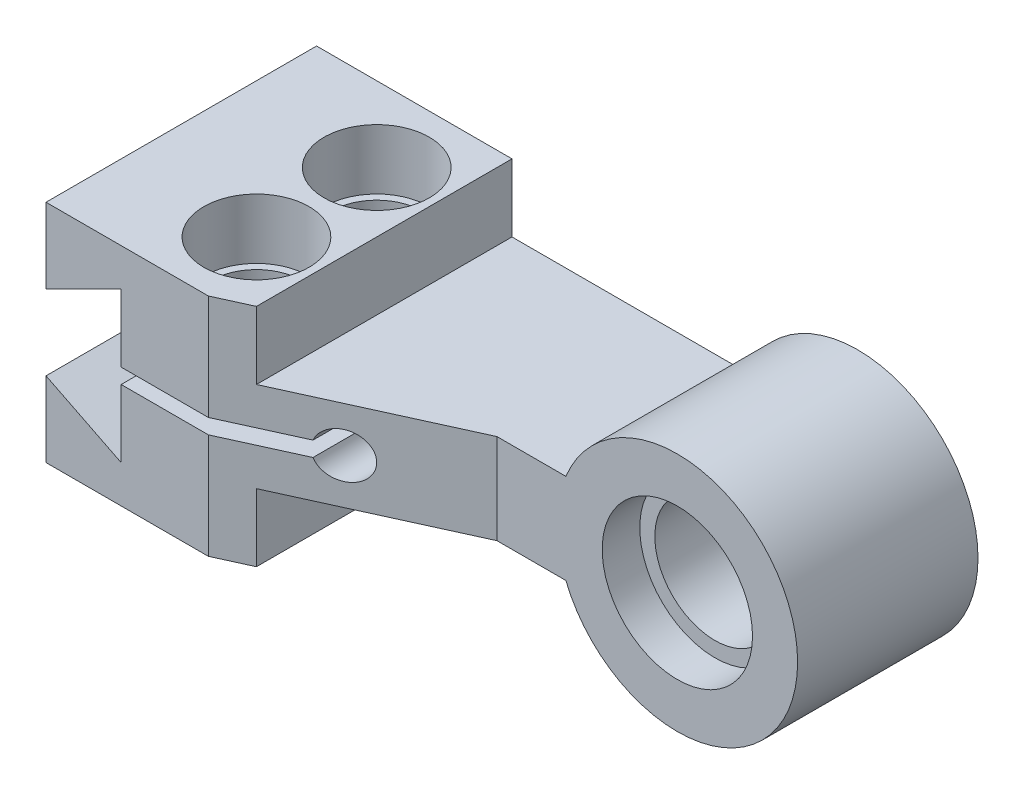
ISO-10303-21;
HEADER;
FILE_DESCRIPTION(('STEP AP214'),'2;1');
FILE_NAME('part.step','',(''),(''),'','','');
FILE_SCHEMA(('AUTOMOTIVE_DESIGN { 1 0 10303 214 1 1 1 1 }'));
ENDSEC;
DATA;
#1=APPLICATION_CONTEXT('core data for automotive mechanical design processes');
#2=APPLICATION_PROTOCOL_DEFINITION('international standard','automotive_design',2000,#1);
#3=PRODUCT_CONTEXT('',#1,'mechanical');
#4=PRODUCT('Part','Part','',(#3));
#5=PRODUCT_RELATED_PRODUCT_CATEGORY('part','',(#4));
#6=PRODUCT_DEFINITION_FORMATION('','',#4);
#7=PRODUCT_DEFINITION_CONTEXT('part definition',#1,'design');
#8=PRODUCT_DEFINITION('design','',#6,#7);
#9=PRODUCT_DEFINITION_SHAPE('','',#8);
#10=(LENGTH_UNIT() NAMED_UNIT(*) SI_UNIT(.MILLI.,.METRE.));
#11=(NAMED_UNIT(*) PLANE_ANGLE_UNIT() SI_UNIT($,.RADIAN.));
#12=(NAMED_UNIT(*) SI_UNIT($,.STERADIAN.) SOLID_ANGLE_UNIT());
#13=UNCERTAINTY_MEASURE_WITH_UNIT(LENGTH_MEASURE(1.E-05),#10,'distance_accuracy_value','');
#14=(GEOMETRIC_REPRESENTATION_CONTEXT(3) GLOBAL_UNCERTAINTY_ASSIGNED_CONTEXT((#13)) GLOBAL_UNIT_ASSIGNED_CONTEXT((#10,
#11,#12)) REPRESENTATION_CONTEXT('',''));
#15=CARTESIAN_POINT('',(0.,0.,0.));
#16=DIRECTION('',(0.,0.,1.));
#17=DIRECTION('',(1.,0.,0.));
#18=AXIS2_PLACEMENT_3D('',#15,#16,#17);
#19=CARTESIAN_POINT('',(0.,0.,12.));
#20=DIRECTION('',(0.,0.,-1.));
#21=DIRECTION('',(-1.,0.,0.));
#22=AXIS2_PLACEMENT_3D('',#19,#20,#21);
#23=CYLINDRICAL_SURFACE('',#22,4.);
#24=CARTESIAN_POINT('',(0.,0.,0.));
#25=DIRECTION('',(0.,0.,1.));
#26=DIRECTION('',(1.,0.,0.));
#27=AXIS2_PLACEMENT_3D('',#24,#25,#26);
#28=CIRCLE('',#27,4.);
#29=CARTESIAN_POINT('',(4.,0.,0.));
#30=VERTEX_POINT('',#29);
#31=EDGE_CURVE('E396',#30,#30,#28,.T.);
#32=ORIENTED_EDGE('',*,*,#31,.F.);
#33=EDGE_LOOP('',(#32));
#34=FACE_BOUND('',#33,.T.);
#35=CARTESIAN_POINT('',(0.,0.,9.5));
#36=DIRECTION('',(0.,0.,1.));
#37=DIRECTION('',(1.,0.,0.));
#38=AXIS2_PLACEMENT_3D('',#35,#36,#37);
#39=CIRCLE('',#38,4.);
#40=CARTESIAN_POINT('',(4.,0.,9.5));
#41=VERTEX_POINT('',#40);
#42=EDGE_CURVE('E35',#41,#41,#39,.T.);
#43=ORIENTED_EDGE('',*,*,#42,.T.);
#44=EDGE_LOOP('',(#43));
#45=FACE_BOUND('',#44,.T.);
#46=ADVANCED_FACE('F31',(#34,#45),#23,.F.);
#47=CARTESIAN_POINT('',(-23.,-7.5,18.));
#48=DIRECTION('',(0.,1.,0.));
#49=DIRECTION('',(0.,0.,1.));
#50=AXIS2_PLACEMENT_3D('',#47,#48,#49);
#51=PLANE('',#50);
#52=CARTESIAN_POINT('',(-27.,-7.5,5.));
#53=DIRECTION('',(0.,-1.,0.));
#54=DIRECTION('',(0.,0.,-1.));
#55=AXIS2_PLACEMENT_3D('',#52,#53,#54);
#56=CIRCLE('',#55,2.5);
#57=CARTESIAN_POINT('',(-27.,-7.5,2.5));
#58=VERTEX_POINT('',#57);
#59=EDGE_CURVE('E740',#58,#58,#56,.T.);
#60=ORIENTED_EDGE('',*,*,#59,.F.);
#61=EDGE_LOOP('',(#60));
#62=FACE_BOUND('',#61,.T.);
#63=DIRECTION('',(0.,0.,-1.));
#64=VECTOR('',#63,1.);
#65=CARTESIAN_POINT('',(-23.,-7.5,0.));
#66=LINE('',#65,#64);
#67=CARTESIAN_POINT('',(-23.,-7.5,17.));
#68=VERTEX_POINT('',#67);
#69=CARTESIAN_POINT('',(-23.,-7.5,0.));
#70=VERTEX_POINT('',#69);
#71=EDGE_CURVE('E236',#68,#70,#66,.T.);
#72=ORIENTED_EDGE('',*,*,#71,.F.);
#73=DIRECTION('',(0.910366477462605,0.,-0.413802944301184));
#74=VECTOR('',#73,1.);
#75=CARTESIAN_POINT('',(-25.2,-7.5,18.));
#76=LINE('',#75,#74);
#77=CARTESIAN_POINT('',(-25.2,-7.5,18.));
#78=VERTEX_POINT('',#77);
#79=EDGE_CURVE('E241',#78,#68,#76,.T.);
#80=ORIENTED_EDGE('',*,*,#79,.F.);
#81=DIRECTION('',(1.,0.,0.));
#82=VECTOR('',#81,1.);
#83=CARTESIAN_POINT('',(-36.,-7.5,18.));
#84=LINE('',#83,#82);
#85=CARTESIAN_POINT('',(-36.,-7.5,18.));
#86=VERTEX_POINT('',#85);
#87=EDGE_CURVE('E258',#86,#78,#84,.T.);
#88=ORIENTED_EDGE('',*,*,#87,.F.);
#89=DIRECTION('',(0.,0.,1.));
#90=VECTOR('',#89,1.);
#91=CARTESIAN_POINT('',(-36.,-7.5,0.));
#92=LINE('',#91,#90);
#93=CARTESIAN_POINT('',(-36.,-7.5,0.));
#94=VERTEX_POINT('',#93);
#95=EDGE_CURVE('E255',#94,#86,#92,.T.);
#96=ORIENTED_EDGE('',*,*,#95,.F.);
#97=DIRECTION('',(-1.,0.,0.));
#98=VECTOR('',#97,1.);
#99=CARTESIAN_POINT('',(-23.,-7.5,0.));
#100=LINE('',#99,#98);
#101=EDGE_CURVE('E252',#70,#94,#100,.T.);
#102=ORIENTED_EDGE('',*,*,#101,.F.);
#103=EDGE_LOOP('',(#72,#80,#88,#96,#102));
#104=FACE_BOUND('',#103,.T.);
#105=CARTESIAN_POINT('',(-27.,-7.5,13.));
#106=DIRECTION('',(0.,-1.,0.));
#107=DIRECTION('',(0.,0.,-1.));
#108=AXIS2_PLACEMENT_3D('',#105,#106,#107);
#109=CIRCLE('',#108,2.5);
#110=CARTESIAN_POINT('',(-27.,-7.5,10.5));
#111=VERTEX_POINT('',#110);
#112=EDGE_CURVE('E732',#111,#111,#109,.T.);
#113=ORIENTED_EDGE('',*,*,#112,.F.);
#114=EDGE_LOOP('',(#113));
#115=FACE_BOUND('',#114,.T.);
#116=ADVANCED_FACE('F305',(#62,#104,#115),#51,.F.);
#117=CARTESIAN_POINT('',(-27.,-8.001,13.));
#118=DIRECTION('',(0.,1.,0.));
#119=DIRECTION('',(0.,0.,1.));
#120=AXIS2_PLACEMENT_3D('',#117,#118,#119);
#121=CYLINDRICAL_SURFACE('',#120,2.99999999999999);
#122=CARTESIAN_POINT('',(-27.,0.5,13.));
#123=DIRECTION('',(0.,-1.,0.));
#124=DIRECTION('',(1.,0.,0.));
#125=AXIS2_PLACEMENT_3D('',#122,#123,#124);
#126=CIRCLE('',#125,2.99999999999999);
#127=CARTESIAN_POINT('',(-24.,0.500000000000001,13.));
#128=VERTEX_POINT('',#127);
#129=EDGE_CURVE('E199',#128,#128,#126,.F.);
#130=ORIENTED_EDGE('',*,*,#129,.F.);
#131=EDGE_LOOP('',(#130));
#132=FACE_BOUND('',#131,.T.);
#133=CARTESIAN_POINT('',(-27.,3.5,13.));
#134=DIRECTION('',(0.,1.,0.));
#135=DIRECTION('',(0.,0.,1.));
#136=AXIS2_PLACEMENT_3D('',#133,#134,#135);
#137=CIRCLE('',#136,2.99999999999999);
#138=CARTESIAN_POINT('',(-27.,3.5,16.));
#139=VERTEX_POINT('',#138);
#140=EDGE_CURVE('E332',#139,#139,#137,.F.);
#141=ORIENTED_EDGE('',*,*,#140,.F.);
#142=EDGE_LOOP('',(#141));
#143=FACE_BOUND('',#142,.T.);
#144=ADVANCED_FACE('F359',(#132,#143),#121,.F.);
#145=CARTESIAN_POINT('',(-27.,-8.001,5.));
#146=DIRECTION('',(0.,1.,0.));
#147=DIRECTION('',(0.,0.,1.));
#148=AXIS2_PLACEMENT_3D('',#145,#146,#147);
#149=CYLINDRICAL_SURFACE('',#148,2.99999999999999);
#150=CARTESIAN_POINT('',(-27.,0.5,5.));
#151=DIRECTION('',(0.,-1.,0.));
#152=DIRECTION('',(1.,0.,0.));
#153=AXIS2_PLACEMENT_3D('',#150,#151,#152);
#154=CIRCLE('',#153,2.99999999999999);
#155=CARTESIAN_POINT('',(-24.,0.500000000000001,5.));
#156=VERTEX_POINT('',#155);
#157=EDGE_CURVE('E330',#156,#156,#154,.F.);
#158=ORIENTED_EDGE('',*,*,#157,.F.);
#159=EDGE_LOOP('',(#158));
#160=FACE_BOUND('',#159,.T.);
#161=CARTESIAN_POINT('',(-27.,3.5,5.));
#162=DIRECTION('',(0.,1.,0.));
#163=DIRECTION('',(0.,0.,1.));
#164=AXIS2_PLACEMENT_3D('',#161,#162,#163);
#165=CIRCLE('',#164,2.99999999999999);
#166=CARTESIAN_POINT('',(-27.,3.5,7.99999999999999));
#167=VERTEX_POINT('',#166);
#168=EDGE_CURVE('E328',#167,#167,#165,.F.);
#169=ORIENTED_EDGE('',*,*,#168,.F.);
#170=EDGE_LOOP('',(#169));
#171=FACE_BOUND('',#170,.T.);
#172=ADVANCED_FACE('F362',(#160,#171),#149,.F.);
#173=CARTESIAN_POINT('',(0.,0.,0.));
#174=DIRECTION('',(0.,0.,1.));
#175=DIRECTION('',(1.,0.,0.));
#176=AXIS2_PLACEMENT_3D('',#173,#174,#175);
#177=PLANE('',#176);
#178=ORIENTED_EDGE('',*,*,#31,.T.);
#179=EDGE_LOOP('',(#178));
#180=FACE_BOUND('',#179,.T.);
#181=DIRECTION('',(-0.894427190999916,-0.447213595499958,0.));
#182=VECTOR('',#181,1.);
#183=CARTESIAN_POINT('',(-31.,5.,0.));
#184=LINE('',#183,#182);
#185=CARTESIAN_POINT('',(-31.,5.,0.));
#186=VERTEX_POINT('',#185);
#187=CARTESIAN_POINT('',(-36.,2.5,0.));
#188=VERTEX_POINT('',#187);
#189=EDGE_CURVE('E214',#186,#188,#184,.T.);
#190=ORIENTED_EDGE('',*,*,#189,.T.);
#191=DIRECTION('',(0.,-1.,0.));
#192=VECTOR('',#191,1.);
#193=CARTESIAN_POINT('',(-36.,7.5,0.));
#194=LINE('',#193,#192);
#195=CARTESIAN_POINT('',(-36.,7.5,0.));
#196=VERTEX_POINT('',#195);
#197=EDGE_CURVE('E278',#196,#188,#194,.T.);
#198=ORIENTED_EDGE('',*,*,#197,.F.);
#199=DIRECTION('',(-1.,0.,0.));
#200=VECTOR('',#199,1.);
#201=CARTESIAN_POINT('',(-23.,7.5,0.));
#202=LINE('',#201,#200);
#203=CARTESIAN_POINT('',(-23.,7.5,0.));
#204=VERTEX_POINT('',#203);
#205=EDGE_CURVE('E240',#204,#196,#202,.T.);
#206=ORIENTED_EDGE('',*,*,#205,.F.);
#207=DIRECTION('',(0.,-1.,0.));
#208=VECTOR('',#207,1.);
#209=CARTESIAN_POINT('',(-23.,7.5,0.));
#210=LINE('',#209,#208);
#211=CARTESIAN_POINT('',(-23.,3.,0.));
#212=VERTEX_POINT('',#211);
#213=EDGE_CURVE('E277',#204,#212,#210,.T.);
#214=ORIENTED_EDGE('',*,*,#213,.T.);
#215=DIRECTION('',(-1.,0.,0.));
#216=VECTOR('',#215,1.);
#217=CARTESIAN_POINT('',(-23.,3.,0.));
#218=LINE('',#217,#216);
#219=CARTESIAN_POINT('',(-7.41619848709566,3.,0.));
#220=VERTEX_POINT('',#219);
#221=EDGE_CURVE('E320',#220,#212,#218,.T.);
#222=ORIENTED_EDGE('',*,*,#221,.F.);
#223=CARTESIAN_POINT('',(0.,0.,0.));
#224=DIRECTION('',(0.,0.,1.));
#225=DIRECTION('',(1.,0.,0.));
#226=AXIS2_PLACEMENT_3D('',#223,#224,#225);
#227=CIRCLE('',#226,8.);
#228=CARTESIAN_POINT('',(-7.41619848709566,-3.,0.));
#229=VERTEX_POINT('',#228);
#230=EDGE_CURVE('E428',#229,#220,#227,.T.);
#231=ORIENTED_EDGE('',*,*,#230,.F.);
#232=DIRECTION('',(-1.,0.,0.));
#233=VECTOR('',#232,1.);
#234=CARTESIAN_POINT('',(-23.,-3.,0.));
#235=LINE('',#234,#233);
#236=CARTESIAN_POINT('',(-23.,-3.,0.));
#237=VERTEX_POINT('',#236);
#238=EDGE_CURVE('E56',#229,#237,#235,.T.);
#239=ORIENTED_EDGE('',*,*,#238,.T.);
#240=EDGE_CURVE('E274',#237,#70,#210,.T.);
#241=ORIENTED_EDGE('',*,*,#240,.T.);
#242=ORIENTED_EDGE('',*,*,#101,.T.);
#243=CARTESIAN_POINT('',(-36.,-2.5,0.));
#244=VERTEX_POINT('',#243);
#245=EDGE_CURVE('E283',#244,#94,#194,.T.);
#246=ORIENTED_EDGE('',*,*,#245,.F.);
#247=DIRECTION('',(0.894427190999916,-0.447213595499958,0.));
#248=VECTOR('',#247,1.);
#249=CARTESIAN_POINT('',(-31.,-5.,0.));
#250=LINE('',#249,#248);
#251=CARTESIAN_POINT('',(-31.,-5.,0.));
#252=VERTEX_POINT('',#251);
#253=EDGE_CURVE('E217',#244,#252,#250,.T.);
#254=ORIENTED_EDGE('',*,*,#253,.T.);
#255=DIRECTION('',(0.,1.,0.));
#256=VECTOR('',#255,1.);
#257=CARTESIAN_POINT('',(-31.,-0.5,0.));
#258=LINE('',#257,#256);
#259=CARTESIAN_POINT('',(-31.,-0.5,0.));
#260=VERTEX_POINT('',#259);
#261=EDGE_CURVE('E196',#252,#260,#258,.T.);
#262=ORIENTED_EDGE('',*,*,#261,.T.);
#263=DIRECTION('',(1.,0.,0.));
#264=VECTOR('',#263,1.);
#265=CARTESIAN_POINT('',(-20.4142135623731,-0.500000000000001,0.));
#266=LINE('',#265,#264);
#267=CARTESIAN_POINT('',(-20.4142135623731,-0.500000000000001,0.));
#268=VERTEX_POINT('',#267);
#269=EDGE_CURVE('E191',#260,#268,#266,.T.);
#270=ORIENTED_EDGE('',*,*,#269,.T.);
#271=CARTESIAN_POINT('',(-19.,0.,0.));
#272=DIRECTION('',(0.,0.,1.));
#273=DIRECTION('',(1.,0.,0.));
#274=AXIS2_PLACEMENT_3D('',#271,#272,#273);
#275=CIRCLE('',#274,1.5);
#276=CARTESIAN_POINT('',(-20.4142135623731,0.500000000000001,0.));
#277=VERTEX_POINT('',#276);
#278=EDGE_CURVE('E208',#268,#277,#275,.T.);
#279=ORIENTED_EDGE('',*,*,#278,.T.);
#280=DIRECTION('',(-1.,0.,0.));
#281=VECTOR('',#280,1.);
#282=CARTESIAN_POINT('',(-20.4142135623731,0.500000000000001,0.));
#283=LINE('',#282,#281);
#284=CARTESIAN_POINT('',(-31.,0.5,0.));
#285=VERTEX_POINT('',#284);
#286=EDGE_CURVE('E211',#277,#285,#283,.T.);
#287=ORIENTED_EDGE('',*,*,#286,.T.);
#288=DIRECTION('',(0.,1.,0.));
#289=VECTOR('',#288,1.);
#290=CARTESIAN_POINT('',(-31.,0.5,0.));
#291=LINE('',#290,#289);
#292=EDGE_CURVE('E182',#285,#186,#291,.T.);
#293=ORIENTED_EDGE('',*,*,#292,.T.);
#294=EDGE_LOOP('',(#190,#198,#206,#214,#222,#231,#239,#241,#242,#246,#254,#262,#270,#279,#287,#293));
#295=FACE_BOUND('',#294,.T.);
#296=ADVANCED_FACE('F368',(#180,#295),#177,.F.);
#297=CARTESIAN_POINT('',(-23.,3.,17.));
#298=DIRECTION('',(-0.413802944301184,0.,-0.910366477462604));
#299=DIRECTION('',(-0.910366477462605,0.,0.413802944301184));
#300=AXIS2_PLACEMENT_3D('',#297,#298,#299);
#301=PLANE('',#300);
#302=DIRECTION('',(-0.910366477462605,0.,0.413802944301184));
#303=VECTOR('',#302,1.);
#304=CARTESIAN_POINT('',(-23.,0.500000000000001,17.));
#305=LINE('',#304,#303);
#306=CARTESIAN_POINT('',(-20.4142135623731,0.500000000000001,15.8246425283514));
#307=VERTEX_POINT('',#306);
#308=CARTESIAN_POINT('',(-25.2,0.500000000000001,18.));
#309=VERTEX_POINT('',#308);
#310=EDGE_CURVE('E170',#307,#309,#305,.T.);
#311=ORIENTED_EDGE('',*,*,#310,.F.);
#312=CARTESIAN_POINT('',(-19.,0.,15.1818181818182));
#313=DIRECTION('',(-0.413802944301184,0.,-0.910366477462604));
#314=DIRECTION('',(0.910366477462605,0.,-0.413802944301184));
#315=AXIS2_PLACEMENT_3D('',#312,#313,#314);
#316=ELLIPSE('',#315,1.64768808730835,1.5);
#317=CARTESIAN_POINT('',(-20.4142135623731,-0.500000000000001,15.8246425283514));
#318=VERTEX_POINT('',#317);
#319=EDGE_CURVE('E11',#318,#307,#316,.F.);
#320=ORIENTED_EDGE('',*,*,#319,.F.);
#321=DIRECTION('',(0.910366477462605,0.,-0.413802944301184));
#322=VECTOR('',#321,1.);
#323=CARTESIAN_POINT('',(-23.,-0.500000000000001,17.));
#324=LINE('',#323,#322);
#325=CARTESIAN_POINT('',(-25.2,-0.500000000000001,18.));
#326=VERTEX_POINT('',#325);
#327=EDGE_CURVE('E233',#326,#318,#324,.T.);
#328=ORIENTED_EDGE('',*,*,#327,.F.);
#329=DIRECTION('',(0.,-1.,0.));
#330=VECTOR('',#329,1.);
#331=CARTESIAN_POINT('',(-25.2,7.5,18.));
#332=LINE('',#331,#330);
#333=EDGE_CURVE('E273',#326,#78,#332,.T.);
#334=ORIENTED_EDGE('',*,*,#333,.T.);
#335=ORIENTED_EDGE('',*,*,#79,.T.);
#336=DIRECTION('',(0.,-1.,0.));
#337=VECTOR('',#336,1.);
#338=CARTESIAN_POINT('',(-23.,7.5,17.));
#339=LINE('',#338,#337);
#340=CARTESIAN_POINT('',(-23.,-3.,17.));
#341=VERTEX_POINT('',#340);
#342=EDGE_CURVE('E249',#341,#68,#339,.T.);
#343=ORIENTED_EDGE('',*,*,#342,.F.);
#344=DIRECTION('',(0.910366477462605,0.,-0.413802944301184));
#345=VECTOR('',#344,1.);
#346=CARTESIAN_POINT('',(-23.,-3.,17.));
#347=LINE('',#346,#345);
#348=CARTESIAN_POINT('',(-12.,-3.,12.));
#349=VERTEX_POINT('',#348);
#350=EDGE_CURVE('E313',#341,#349,#347,.T.);
#351=ORIENTED_EDGE('',*,*,#350,.T.);
#352=DIRECTION('',(0.,-1.,0.));
#353=VECTOR('',#352,1.);
#354=CARTESIAN_POINT('',(-12.,3.,12.));
#355=LINE('',#354,#353);
#356=CARTESIAN_POINT('',(-12.,3.,12.));
#357=VERTEX_POINT('',#356);
#358=EDGE_CURVE('E435',#357,#349,#355,.T.);
#359=ORIENTED_EDGE('',*,*,#358,.F.);
#360=DIRECTION('',(0.910366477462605,0.,-0.413802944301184));
#361=VECTOR('',#360,1.);
#362=CARTESIAN_POINT('',(-23.,3.,17.));
#363=LINE('',#362,#361);
#364=CARTESIAN_POINT('',(-23.,3.,17.));
#365=VERTEX_POINT('',#364);
#366=EDGE_CURVE('E419',#365,#357,#363,.T.);
#367=ORIENTED_EDGE('',*,*,#366,.F.);
#368=CARTESIAN_POINT('',(-23.,7.5,17.));
#369=VERTEX_POINT('',#368);
#370=EDGE_CURVE('E271',#369,#365,#339,.T.);
#371=ORIENTED_EDGE('',*,*,#370,.F.);
#372=DIRECTION('',(0.910366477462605,0.,-0.413802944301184));
#373=VECTOR('',#372,1.);
#374=CARTESIAN_POINT('',(-25.2,7.5,18.));
#375=LINE('',#374,#373);
#376=CARTESIAN_POINT('',(-25.2,7.5,18.));
#377=VERTEX_POINT('',#376);
#378=EDGE_CURVE('E247',#377,#369,#375,.T.);
#379=ORIENTED_EDGE('',*,*,#378,.F.);
#380=EDGE_CURVE('E265',#377,#309,#332,.T.);
#381=ORIENTED_EDGE('',*,*,#380,.T.);
#382=EDGE_LOOP('',(#311,#320,#328,#334,#335,#343,#351,#359,#367,#371,#379,#381));
#383=FACE_BOUND('',#382,.T.);
#384=ADVANCED_FACE('F295',(#383),#301,.F.);
#385=CARTESIAN_POINT('',(-36.,7.5,0.));
#386=DIRECTION('',(1.,0.,0.));
#387=DIRECTION('',(0.,0.,-1.));
#388=AXIS2_PLACEMENT_3D('',#385,#386,#387);
#389=PLANE('',#388);
#390=DIRECTION('',(0.,0.,-1.));
#391=VECTOR('',#390,1.);
#392=CARTESIAN_POINT('',(-36.,2.5,18.));
#393=LINE('',#392,#391);
#394=CARTESIAN_POINT('',(-36.,2.5,18.));
#395=VERTEX_POINT('',#394);
#396=EDGE_CURVE('E229',#395,#188,#393,.T.);
#397=ORIENTED_EDGE('',*,*,#396,.F.);
#398=DIRECTION('',(0.,-1.,0.));
#399=VECTOR('',#398,1.);
#400=CARTESIAN_POINT('',(-36.,7.5,18.));
#401=LINE('',#400,#399);
#402=CARTESIAN_POINT('',(-36.,7.5,18.));
#403=VERTEX_POINT('',#402);
#404=EDGE_CURVE('E284',#403,#395,#401,.T.);
#405=ORIENTED_EDGE('',*,*,#404,.F.);
#406=DIRECTION('',(0.,0.,1.));
#407=VECTOR('',#406,1.);
#408=CARTESIAN_POINT('',(-36.,7.5,0.));
#409=LINE('',#408,#407);
#410=EDGE_CURVE('E243',#196,#403,#409,.T.);
#411=ORIENTED_EDGE('',*,*,#410,.F.);
#412=ORIENTED_EDGE('',*,*,#197,.T.);
#413=EDGE_LOOP('',(#397,#405,#411,#412));
#414=FACE_BOUND('',#413,.T.);
#415=ADVANCED_FACE('F393',(#414),#389,.F.);
#416=DIRECTION('',(0.,0.,-1.));
#417=VECTOR('',#416,1.);
#418=CARTESIAN_POINT('',(-36.,-2.5,18.));
#419=LINE('',#418,#417);
#420=CARTESIAN_POINT('',(-36.,-2.5,18.));
#421=VERTEX_POINT('',#420);
#422=EDGE_CURVE('E226',#421,#244,#419,.T.);
#423=ORIENTED_EDGE('',*,*,#422,.T.);
#424=ORIENTED_EDGE('',*,*,#245,.T.);
#425=ORIENTED_EDGE('',*,*,#95,.T.);
#426=EDGE_CURVE('E285',#421,#86,#401,.T.);
#427=ORIENTED_EDGE('',*,*,#426,.F.);
#428=EDGE_LOOP('',(#423,#424,#425,#427));
#429=FACE_BOUND('',#428,.T.);
#430=ADVANCED_FACE('F456',(#429),#389,.F.);
#431=CARTESIAN_POINT('',(-36.,7.5,18.));
#432=DIRECTION('',(0.,0.,-1.));
#433=DIRECTION('',(-1.,0.,0.));
#434=AXIS2_PLACEMENT_3D('',#431,#432,#433);
#435=PLANE('',#434);
#436=DIRECTION('',(-1.,0.,0.));
#437=VECTOR('',#436,1.);
#438=CARTESIAN_POINT('',(-36.,0.5,18.));
#439=LINE('',#438,#437);
#440=CARTESIAN_POINT('',(-31.,0.5,18.));
#441=VERTEX_POINT('',#440);
#442=EDGE_CURVE('E40',#309,#441,#439,.T.);
#443=ORIENTED_EDGE('',*,*,#442,.F.);
#444=ORIENTED_EDGE('',*,*,#380,.F.);
#445=DIRECTION('',(1.,0.,0.));
#446=VECTOR('',#445,1.);
#447=CARTESIAN_POINT('',(-36.,7.5,18.));
#448=LINE('',#447,#446);
#449=EDGE_CURVE('E245',#403,#377,#448,.T.);
#450=ORIENTED_EDGE('',*,*,#449,.F.);
#451=ORIENTED_EDGE('',*,*,#404,.T.);
#452=DIRECTION('',(-0.894427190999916,-0.447213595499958,0.));
#453=VECTOR('',#452,1.);
#454=CARTESIAN_POINT('',(-31.,5.,18.));
#455=LINE('',#454,#453);
#456=CARTESIAN_POINT('',(-31.,5.,18.));
#457=VERTEX_POINT('',#456);
#458=EDGE_CURVE('E190',#457,#395,#455,.T.);
#459=ORIENTED_EDGE('',*,*,#458,.F.);
#460=DIRECTION('',(0.,1.,0.));
#461=VECTOR('',#460,1.);
#462=CARTESIAN_POINT('',(-31.,0.5,18.));
#463=LINE('',#462,#461);
#464=EDGE_CURVE('E179',#441,#457,#463,.T.);
#465=ORIENTED_EDGE('',*,*,#464,.F.);
#466=EDGE_LOOP('',(#443,#444,#450,#451,#459,#465));
#467=FACE_BOUND('',#466,.T.);
#468=ADVANCED_FACE('F188',(#467),#435,.F.);
#469=DIRECTION('',(0.894427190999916,-0.447213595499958,0.));
#470=VECTOR('',#469,1.);
#471=CARTESIAN_POINT('',(-31.,-5.,18.));
#472=LINE('',#471,#470);
#473=CARTESIAN_POINT('',(-31.,-5.,18.));
#474=VERTEX_POINT('',#473);
#475=EDGE_CURVE('E193',#421,#474,#472,.T.);
#476=ORIENTED_EDGE('',*,*,#475,.F.);
#477=ORIENTED_EDGE('',*,*,#426,.T.);
#478=ORIENTED_EDGE('',*,*,#87,.T.);
#479=ORIENTED_EDGE('',*,*,#333,.F.);
#480=DIRECTION('',(1.,0.,0.));
#481=VECTOR('',#480,1.);
#482=CARTESIAN_POINT('',(-20.4142135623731,-0.500000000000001,18.));
#483=LINE('',#482,#481);
#484=CARTESIAN_POINT('',(-31.,-0.499999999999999,18.));
#485=VERTEX_POINT('',#484);
#486=EDGE_CURVE('E205',#485,#326,#483,.T.);
#487=ORIENTED_EDGE('',*,*,#486,.F.);
#488=DIRECTION('',(0.,1.,0.));
#489=VECTOR('',#488,1.);
#490=CARTESIAN_POINT('',(-31.,-0.5,18.));
#491=LINE('',#490,#489);
#492=EDGE_CURVE('E203',#474,#485,#491,.T.);
#493=ORIENTED_EDGE('',*,*,#492,.F.);
#494=EDGE_LOOP('',(#476,#477,#478,#479,#487,#493));
#495=FACE_BOUND('',#494,.T.);
#496=ADVANCED_FACE('F302',(#495),#435,.F.);
#497=CARTESIAN_POINT('',(0.,0.,12.));
#498=DIRECTION('',(0.,0.,-1.));
#499=DIRECTION('',(-1.,0.,0.));
#500=AXIS2_PLACEMENT_3D('',#497,#498,#499);
#501=CYLINDRICAL_SURFACE('',#500,8.);
#502=DIRECTION('',(0.,0.,-1.));
#503=VECTOR('',#502,1.);
#504=CARTESIAN_POINT('',(-7.41619848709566,3.,12.));
#505=LINE('',#504,#503);
#506=CARTESIAN_POINT('',(-7.41619848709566,3.,12.));
#507=VERTEX_POINT('',#506);
#508=EDGE_CURVE('E175',#507,#220,#505,.T.);
#509=ORIENTED_EDGE('',*,*,#508,.F.);
#510=CARTESIAN_POINT('',(0.,0.,12.));
#511=DIRECTION('',(0.,0.,1.));
#512=DIRECTION('',(1.,0.,0.));
#513=AXIS2_PLACEMENT_3D('',#510,#511,#512);
#514=CIRCLE('',#513,8.);
#515=CARTESIAN_POINT('',(-7.41619848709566,-3.,12.));
#516=VERTEX_POINT('',#515);
#517=EDGE_CURVE('E430',#516,#507,#514,.T.);
#518=ORIENTED_EDGE('',*,*,#517,.F.);
#519=DIRECTION('',(0.,0.,-1.));
#520=VECTOR('',#519,1.);
#521=CARTESIAN_POINT('',(-7.41619848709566,-3.,12.));
#522=LINE('',#521,#520);
#523=EDGE_CURVE('E433',#516,#229,#522,.T.);
#524=ORIENTED_EDGE('',*,*,#523,.T.);
#525=ORIENTED_EDGE('',*,*,#230,.T.);
#526=EDGE_LOOP('',(#509,#518,#524,#525));
#527=FACE_BOUND('',#526,.T.);
#528=ADVANCED_FACE('F33',(#527),#501,.T.);
#529=CARTESIAN_POINT('',(0.,0.,12.));
#530=DIRECTION('',(0.,0.,1.));
#531=DIRECTION('',(1.,0.,0.));
#532=AXIS2_PLACEMENT_3D('',#529,#530,#531);
#533=PLANE('',#532);
#534=CARTESIAN_POINT('',(0.,0.,12.));
#535=DIRECTION('',(0.,0.,1.));
#536=DIRECTION('',(1.,0.,0.));
#537=AXIS2_PLACEMENT_3D('',#534,#535,#536);
#538=CIRCLE('',#537,5.);
#539=CARTESIAN_POINT('',(5.,0.,12.));
#540=VERTEX_POINT('',#539);
#541=EDGE_CURVE('E730',#540,#540,#538,.T.);
#542=ORIENTED_EDGE('',*,*,#541,.F.);
#543=EDGE_LOOP('',(#542));
#544=FACE_BOUND('',#543,.T.);
#545=ORIENTED_EDGE('',*,*,#517,.T.);
#546=DIRECTION('',(1.,0.,0.));
#547=VECTOR('',#546,1.);
#548=CARTESIAN_POINT('',(-5.30385941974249,3.,12.));
#549=LINE('',#548,#547);
#550=EDGE_CURVE('E441',#357,#507,#549,.T.);
#551=ORIENTED_EDGE('',*,*,#550,.F.);
#552=ORIENTED_EDGE('',*,*,#358,.T.);
#553=DIRECTION('',(1.,0.,0.));
#554=VECTOR('',#553,1.);
#555=CARTESIAN_POINT('',(-5.30385941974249,-3.,12.));
#556=LINE('',#555,#554);
#557=EDGE_CURVE('E318',#349,#516,#556,.T.);
#558=ORIENTED_EDGE('',*,*,#557,.T.);
#559=EDGE_LOOP('',(#545,#551,#552,#558));
#560=FACE_BOUND('',#559,.T.);
#561=ADVANCED_FACE('F384',(#544,#560),#533,.T.);
#562=CARTESIAN_POINT('',(-23.,3.,0.));
#563=DIRECTION('',(0.,-1.,0.));
#564=DIRECTION('',(0.,0.,-1.));
#565=AXIS2_PLACEMENT_3D('',#562,#563,#564);
#566=PLANE('',#565);
#567=ORIENTED_EDGE('',*,*,#550,.T.);
#568=ORIENTED_EDGE('',*,*,#508,.T.);
#569=ORIENTED_EDGE('',*,*,#221,.T.);
#570=DIRECTION('',(0.,0.,1.));
#571=VECTOR('',#570,1.);
#572=CARTESIAN_POINT('',(-23.,3.,0.));
#573=LINE('',#572,#571);
#574=EDGE_CURVE('E415',#212,#365,#573,.T.);
#575=ORIENTED_EDGE('',*,*,#574,.T.);
#576=ORIENTED_EDGE('',*,*,#366,.T.);
#577=EDGE_LOOP('',(#567,#568,#569,#575,#576));
#578=FACE_BOUND('',#577,.T.);
#579=ADVANCED_FACE('F386',(#578),#566,.F.);
#580=CARTESIAN_POINT('',(-23.,-3.,0.));
#581=DIRECTION('',(0.,-1.,0.));
#582=DIRECTION('',(0.,0.,-1.));
#583=AXIS2_PLACEMENT_3D('',#580,#581,#582);
#584=PLANE('',#583);
#585=ORIENTED_EDGE('',*,*,#523,.F.);
#586=ORIENTED_EDGE('',*,*,#557,.F.);
#587=ORIENTED_EDGE('',*,*,#350,.F.);
#588=DIRECTION('',(0.,0.,1.));
#589=VECTOR('',#588,1.);
#590=CARTESIAN_POINT('',(-23.,-3.,0.));
#591=LINE('',#590,#589);
#592=EDGE_CURVE('E310',#237,#341,#591,.T.);
#593=ORIENTED_EDGE('',*,*,#592,.F.);
#594=ORIENTED_EDGE('',*,*,#238,.F.);
#595=EDGE_LOOP('',(#585,#586,#587,#593,#594));
#596=FACE_BOUND('',#595,.T.);
#597=ADVANCED_FACE('F316',(#596),#584,.T.);
#598=CARTESIAN_POINT('',(-23.,7.5,0.));
#599=DIRECTION('',(-1.,0.,0.));
#600=DIRECTION('',(0.,0.,1.));
#601=AXIS2_PLACEMENT_3D('',#598,#599,#600);
#602=PLANE('',#601);
#603=ORIENTED_EDGE('',*,*,#240,.F.);
#604=ORIENTED_EDGE('',*,*,#592,.T.);
#605=ORIENTED_EDGE('',*,*,#342,.T.);
#606=ORIENTED_EDGE('',*,*,#71,.T.);
#607=EDGE_LOOP('',(#603,#604,#605,#606));
#608=FACE_BOUND('',#607,.T.);
#609=ADVANCED_FACE('F309',(#608),#602,.F.);
#610=ORIENTED_EDGE('',*,*,#574,.F.);
#611=ORIENTED_EDGE('',*,*,#213,.F.);
#612=DIRECTION('',(0.,0.,-1.));
#613=VECTOR('',#612,1.);
#614=CARTESIAN_POINT('',(-23.,7.5,0.));
#615=LINE('',#614,#613);
#616=EDGE_CURVE('E237',#369,#204,#615,.T.);
#617=ORIENTED_EDGE('',*,*,#616,.F.);
#618=ORIENTED_EDGE('',*,*,#370,.T.);
#619=EDGE_LOOP('',(#610,#611,#617,#618));
#620=FACE_BOUND('',#619,.T.);
#621=ADVANCED_FACE('F461',(#620),#602,.F.);
#622=CARTESIAN_POINT('',(-23.,7.5,18.));
#623=DIRECTION('',(0.,1.,0.));
#624=DIRECTION('',(0.,0.,1.));
#625=AXIS2_PLACEMENT_3D('',#622,#623,#624);
#626=PLANE('',#625);
#627=CARTESIAN_POINT('',(-27.,7.5,13.));
#628=DIRECTION('',(0.,1.,0.));
#629=DIRECTION('',(0.,0.,1.));
#630=AXIS2_PLACEMENT_3D('',#627,#628,#629);
#631=CIRCLE('',#630,3.5);
#632=CARTESIAN_POINT('',(-27.,7.5,16.5));
#633=VERTEX_POINT('',#632);
#634=EDGE_CURVE('E341',#633,#633,#631,.T.);
#635=ORIENTED_EDGE('',*,*,#634,.F.);
#636=EDGE_LOOP('',(#635));
#637=FACE_BOUND('',#636,.T.);
#638=CARTESIAN_POINT('',(-27.,7.5,5.));
#639=DIRECTION('',(0.,1.,0.));
#640=DIRECTION('',(0.,0.,1.));
#641=AXIS2_PLACEMENT_3D('',#638,#639,#640);
#642=CIRCLE('',#641,3.5);
#643=CARTESIAN_POINT('',(-27.,7.5,8.5));
#644=VERTEX_POINT('',#643);
#645=EDGE_CURVE('E334',#644,#644,#642,.T.);
#646=ORIENTED_EDGE('',*,*,#645,.F.);
#647=EDGE_LOOP('',(#646));
#648=FACE_BOUND('',#647,.T.);
#649=ORIENTED_EDGE('',*,*,#616,.T.);
#650=ORIENTED_EDGE('',*,*,#205,.T.);
#651=ORIENTED_EDGE('',*,*,#410,.T.);
#652=ORIENTED_EDGE('',*,*,#449,.T.);
#653=ORIENTED_EDGE('',*,*,#378,.T.);
#654=EDGE_LOOP('',(#649,#650,#651,#652,#653));
#655=FACE_BOUND('',#654,.T.);
#656=ADVANCED_FACE('F404',(#637,#648,#655),#626,.T.);
#657=CARTESIAN_POINT('',(-19.,0.,18.));
#658=DIRECTION('',(0.,0.,-1.));
#659=DIRECTION('',(-1.,0.,0.));
#660=AXIS2_PLACEMENT_3D('',#657,#658,#659);
#661=CYLINDRICAL_SURFACE('',#660,1.5);
#662=ORIENTED_EDGE('',*,*,#319,.T.);
#663=DIRECTION('',(0.,0.,-1.));
#664=VECTOR('',#663,1.);
#665=CARTESIAN_POINT('',(-20.4142135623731,0.500000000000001,18.));
#666=LINE('',#665,#664);
#667=EDGE_CURVE('E184',#307,#277,#666,.T.);
#668=ORIENTED_EDGE('',*,*,#667,.T.);
#669=ORIENTED_EDGE('',*,*,#278,.F.);
#670=DIRECTION('',(0.,0.,-1.));
#671=VECTOR('',#670,1.);
#672=CARTESIAN_POINT('',(-20.4142135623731,-0.500000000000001,18.));
#673=LINE('',#672,#671);
#674=EDGE_CURVE('E207',#318,#268,#673,.T.);
#675=ORIENTED_EDGE('',*,*,#674,.F.);
#676=EDGE_LOOP('',(#662,#668,#669,#675));
#677=FACE_BOUND('',#676,.T.);
#678=ADVANCED_FACE('F481',(#677),#661,.F.);
#679=CARTESIAN_POINT('',(-20.4142135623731,0.500000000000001,18.));
#680=DIRECTION('',(0.,-1.,0.));
#681=DIRECTION('',(1.,0.,0.));
#682=AXIS2_PLACEMENT_3D('',#679,#680,#681);
#683=PLANE('',#682);
#684=ORIENTED_EDGE('',*,*,#157,.T.);
#685=EDGE_LOOP('',(#684));
#686=FACE_BOUND('',#685,.T.);
#687=ORIENTED_EDGE('',*,*,#129,.T.);
#688=EDGE_LOOP('',(#687));
#689=FACE_BOUND('',#688,.T.);
#690=ORIENTED_EDGE('',*,*,#310,.T.);
#691=ORIENTED_EDGE('',*,*,#442,.T.);
#692=DIRECTION('',(0.,0.,-1.));
#693=VECTOR('',#692,1.);
#694=CARTESIAN_POINT('',(-31.,0.5,18.));
#695=LINE('',#694,#693);
#696=EDGE_CURVE('E166',#441,#285,#695,.T.);
#697=ORIENTED_EDGE('',*,*,#696,.T.);
#698=ORIENTED_EDGE('',*,*,#286,.F.);
#699=ORIENTED_EDGE('',*,*,#667,.F.);
#700=EDGE_LOOP('',(#690,#691,#697,#698,#699));
#701=FACE_BOUND('',#700,.T.);
#702=ADVANCED_FACE('F164',(#686,#689,#701),#683,.T.);
#703=CARTESIAN_POINT('',(-20.4142135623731,-0.500000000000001,18.));
#704=DIRECTION('',(0.,1.,0.));
#705=DIRECTION('',(-1.,0.,0.));
#706=AXIS2_PLACEMENT_3D('',#703,#704,#705);
#707=PLANE('',#706);
#708=CARTESIAN_POINT('',(-27.,-0.5,13.));
#709=DIRECTION('',(0.,1.,0.));
#710=DIRECTION('',(-1.,0.,0.));
#711=AXIS2_PLACEMENT_3D('',#708,#709,#710);
#712=CIRCLE('',#711,2.5);
#713=CARTESIAN_POINT('',(-29.5,-0.5,13.));
#714=VERTEX_POINT('',#713);
#715=EDGE_CURVE('E738',#714,#714,#712,.T.);
#716=ORIENTED_EDGE('',*,*,#715,.F.);
#717=EDGE_LOOP('',(#716));
#718=FACE_BOUND('',#717,.T.);
#719=CARTESIAN_POINT('',(-27.,-0.5,5.));
#720=DIRECTION('',(0.,1.,0.));
#721=DIRECTION('',(-1.,0.,0.));
#722=AXIS2_PLACEMENT_3D('',#719,#720,#721);
#723=CIRCLE('',#722,2.5);
#724=CARTESIAN_POINT('',(-29.5,-0.5,5.));
#725=VERTEX_POINT('',#724);
#726=EDGE_CURVE('E346',#725,#725,#723,.T.);
#727=ORIENTED_EDGE('',*,*,#726,.F.);
#728=EDGE_LOOP('',(#727));
#729=FACE_BOUND('',#728,.T.);
#730=ORIENTED_EDGE('',*,*,#327,.T.);
#731=ORIENTED_EDGE('',*,*,#674,.T.);
#732=ORIENTED_EDGE('',*,*,#269,.F.);
#733=DIRECTION('',(0.,0.,-1.));
#734=VECTOR('',#733,1.);
#735=CARTESIAN_POINT('',(-31.,-0.5,18.));
#736=LINE('',#735,#734);
#737=EDGE_CURVE('E48',#485,#260,#736,.T.);
#738=ORIENTED_EDGE('',*,*,#737,.F.);
#739=ORIENTED_EDGE('',*,*,#486,.T.);
#740=EDGE_LOOP('',(#730,#731,#732,#738,#739));
#741=FACE_BOUND('',#740,.T.);
#742=ADVANCED_FACE('F498',(#718,#729,#741),#707,.T.);
#743=CARTESIAN_POINT('',(-31.,0.5,18.));
#744=DIRECTION('',(-1.,0.,0.));
#745=DIRECTION('',(0.,0.,1.));
#746=AXIS2_PLACEMENT_3D('',#743,#744,#745);
#747=PLANE('',#746);
#748=ORIENTED_EDGE('',*,*,#292,.F.);
#749=ORIENTED_EDGE('',*,*,#696,.F.);
#750=ORIENTED_EDGE('',*,*,#464,.T.);
#751=DIRECTION('',(0.,0.,-1.));
#752=VECTOR('',#751,1.);
#753=CARTESIAN_POINT('',(-31.,5.,18.));
#754=LINE('',#753,#752);
#755=EDGE_CURVE('E185',#457,#186,#754,.T.);
#756=ORIENTED_EDGE('',*,*,#755,.T.);
#757=EDGE_LOOP('',(#748,#749,#750,#756));
#758=FACE_BOUND('',#757,.T.);
#759=ADVANCED_FACE('F178',(#758),#747,.T.);
#760=CARTESIAN_POINT('',(-31.,5.,18.));
#761=DIRECTION('',(0.447213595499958,-0.894427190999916,0.));
#762=DIRECTION('',(0.894427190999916,0.447213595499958,0.));
#763=AXIS2_PLACEMENT_3D('',#760,#761,#762);
#764=PLANE('',#763);
#765=ORIENTED_EDGE('',*,*,#189,.F.);
#766=ORIENTED_EDGE('',*,*,#755,.F.);
#767=ORIENTED_EDGE('',*,*,#458,.T.);
#768=ORIENTED_EDGE('',*,*,#396,.T.);
#769=EDGE_LOOP('',(#765,#766,#767,#768));
#770=FACE_BOUND('',#769,.T.);
#771=ADVANCED_FACE('F513',(#770),#764,.T.);
#772=CARTESIAN_POINT('',(-31.,-5.,18.));
#773=DIRECTION('',(0.447213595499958,0.894427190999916,0.));
#774=DIRECTION('',(-0.894427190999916,0.447213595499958,0.));
#775=AXIS2_PLACEMENT_3D('',#772,#773,#774);
#776=PLANE('',#775);
#777=ORIENTED_EDGE('',*,*,#253,.F.);
#778=ORIENTED_EDGE('',*,*,#422,.F.);
#779=ORIENTED_EDGE('',*,*,#475,.T.);
#780=DIRECTION('',(0.,0.,-1.));
#781=VECTOR('',#780,1.);
#782=CARTESIAN_POINT('',(-31.,-5.,18.));
#783=LINE('',#782,#781);
#784=EDGE_CURVE('E224',#474,#252,#783,.T.);
#785=ORIENTED_EDGE('',*,*,#784,.T.);
#786=EDGE_LOOP('',(#777,#778,#779,#785));
#787=FACE_BOUND('',#786,.T.);
#788=ADVANCED_FACE('F520',(#787),#776,.T.);
#789=CARTESIAN_POINT('',(-31.,-0.5,18.));
#790=DIRECTION('',(-1.,0.,0.));
#791=DIRECTION('',(0.,0.,1.));
#792=AXIS2_PLACEMENT_3D('',#789,#790,#791);
#793=PLANE('',#792);
#794=ORIENTED_EDGE('',*,*,#261,.F.);
#795=ORIENTED_EDGE('',*,*,#784,.F.);
#796=ORIENTED_EDGE('',*,*,#492,.T.);
#797=ORIENTED_EDGE('',*,*,#737,.T.);
#798=EDGE_LOOP('',(#794,#795,#796,#797));
#799=FACE_BOUND('',#798,.T.);
#800=ADVANCED_FACE('F527',(#799),#793,.T.);
#801=CARTESIAN_POINT('',(-27.,3.5,5.));
#802=DIRECTION('',(0.,1.,0.));
#803=DIRECTION('',(0.,0.,1.));
#804=AXIS2_PLACEMENT_3D('',#801,#802,#803);
#805=PLANE('',#804);
#806=CARTESIAN_POINT('',(-27.,3.5,5.));
#807=DIRECTION('',(0.,1.,0.));
#808=DIRECTION('',(0.,0.,1.));
#809=AXIS2_PLACEMENT_3D('',#806,#807,#808);
#810=CIRCLE('',#809,3.5);
#811=CARTESIAN_POINT('',(-27.,3.5,8.5));
#812=VERTEX_POINT('',#811);
#813=EDGE_CURVE('E331',#812,#812,#810,.T.);
#814=ORIENTED_EDGE('',*,*,#813,.T.);
#815=EDGE_LOOP('',(#814));
#816=FACE_BOUND('',#815,.T.);
#817=ORIENTED_EDGE('',*,*,#168,.T.);
#818=EDGE_LOOP('',(#817));
#819=FACE_BOUND('',#818,.T.);
#820=ADVANCED_FACE('F534',(#816,#819),#805,.T.);
#821=CARTESIAN_POINT('',(-27.,3.5,5.));
#822=DIRECTION('',(0.,1.,0.));
#823=DIRECTION('',(0.,0.,1.));
#824=AXIS2_PLACEMENT_3D('',#821,#822,#823);
#825=CYLINDRICAL_SURFACE('',#824,3.5);
#826=ORIENTED_EDGE('',*,*,#813,.F.);
#827=EDGE_LOOP('',(#826));
#828=FACE_BOUND('',#827,.T.);
#829=ORIENTED_EDGE('',*,*,#645,.T.);
#830=EDGE_LOOP('',(#829));
#831=FACE_BOUND('',#830,.T.);
#832=ADVANCED_FACE('F541',(#828,#831),#825,.F.);
#833=CARTESIAN_POINT('',(-27.,3.5,13.));
#834=DIRECTION('',(0.,1.,0.));
#835=DIRECTION('',(0.,0.,1.));
#836=AXIS2_PLACEMENT_3D('',#833,#834,#835);
#837=PLANE('',#836);
#838=CARTESIAN_POINT('',(-27.,3.5,13.));
#839=DIRECTION('',(0.,1.,0.));
#840=DIRECTION('',(0.,0.,1.));
#841=AXIS2_PLACEMENT_3D('',#838,#839,#840);
#842=CIRCLE('',#841,3.5);
#843=CARTESIAN_POINT('',(-27.,3.5,16.5));
#844=VERTEX_POINT('',#843);
#845=EDGE_CURVE('E335',#844,#844,#842,.T.);
#846=ORIENTED_EDGE('',*,*,#845,.T.);
#847=EDGE_LOOP('',(#846));
#848=FACE_BOUND('',#847,.T.);
#849=ORIENTED_EDGE('',*,*,#140,.T.);
#850=EDGE_LOOP('',(#849));
#851=FACE_BOUND('',#850,.T.);
#852=ADVANCED_FACE('F549',(#848,#851),#837,.T.);
#853=CARTESIAN_POINT('',(-27.,3.5,13.));
#854=DIRECTION('',(0.,1.,0.));
#855=DIRECTION('',(0.,0.,1.));
#856=AXIS2_PLACEMENT_3D('',#853,#854,#855);
#857=CYLINDRICAL_SURFACE('',#856,3.5);
#858=ORIENTED_EDGE('',*,*,#845,.F.);
#859=EDGE_LOOP('',(#858));
#860=FACE_BOUND('',#859,.T.);
#861=ORIENTED_EDGE('',*,*,#634,.T.);
#862=EDGE_LOOP('',(#861));
#863=FACE_BOUND('',#862,.T.);
#864=ADVANCED_FACE('F557',(#860,#863),#857,.F.);
#865=CARTESIAN_POINT('',(-27.,-7.5,5.));
#866=DIRECTION('',(0.,-1.,0.));
#867=DIRECTION('',(0.,0.,-1.));
#868=AXIS2_PLACEMENT_3D('',#865,#866,#867);
#869=CYLINDRICAL_SURFACE('',#868,2.5);
#870=ORIENTED_EDGE('',*,*,#59,.T.);
#871=EDGE_LOOP('',(#870));
#872=FACE_BOUND('',#871,.T.);
#873=ORIENTED_EDGE('',*,*,#726,.T.);
#874=EDGE_LOOP('',(#873));
#875=FACE_BOUND('',#874,.T.);
#876=ADVANCED_FACE('F564',(#872,#875),#869,.F.);
#877=CARTESIAN_POINT('',(-27.,-7.5,13.));
#878=DIRECTION('',(0.,-1.,0.));
#879=DIRECTION('',(0.,0.,-1.));
#880=AXIS2_PLACEMENT_3D('',#877,#878,#879);
#881=CYLINDRICAL_SURFACE('',#880,2.5);
#882=ORIENTED_EDGE('',*,*,#112,.T.);
#883=EDGE_LOOP('',(#882));
#884=FACE_BOUND('',#883,.T.);
#885=ORIENTED_EDGE('',*,*,#715,.T.);
#886=EDGE_LOOP('',(#885));
#887=FACE_BOUND('',#886,.T.);
#888=ADVANCED_FACE('F571',(#884,#887),#881,.F.);
#889=CARTESIAN_POINT('',(0.,0.,9.5));
#890=DIRECTION('',(0.,0.,1.));
#891=DIRECTION('',(1.,0.,0.));
#892=AXIS2_PLACEMENT_3D('',#889,#890,#891);
#893=CYLINDRICAL_SURFACE('',#892,5.);
#894=CARTESIAN_POINT('',(0.,0.,9.5));
#895=DIRECTION('',(0.,0.,1.));
#896=DIRECTION('',(1.,0.,0.));
#897=AXIS2_PLACEMENT_3D('',#894,#895,#896);
#898=CIRCLE('',#897,5.);
#899=CARTESIAN_POINT('',(5.,0.,9.5));
#900=VERTEX_POINT('',#899);
#901=EDGE_CURVE('E729',#900,#900,#898,.T.);
#902=ORIENTED_EDGE('',*,*,#901,.F.);
#903=EDGE_LOOP('',(#902));
#904=FACE_BOUND('',#903,.T.);
#905=ORIENTED_EDGE('',*,*,#541,.T.);
#906=EDGE_LOOP('',(#905));
#907=FACE_BOUND('',#906,.T.);
#908=ADVANCED_FACE('F579',(#904,#907),#893,.F.);
#909=CARTESIAN_POINT('',(0.,0.,9.5));
#910=DIRECTION('',(0.,0.,1.));
#911=DIRECTION('',(1.,0.,0.));
#912=AXIS2_PLACEMENT_3D('',#909,#910,#911);
#913=PLANE('',#912);
#914=ORIENTED_EDGE('',*,*,#42,.F.);
#915=EDGE_LOOP('',(#914));
#916=FACE_BOUND('',#915,.T.);
#917=ORIENTED_EDGE('',*,*,#901,.T.);
#918=EDGE_LOOP('',(#917));
#919=FACE_BOUND('',#918,.T.);
#920=ADVANCED_FACE('F587',(#916,#919),#913,.T.);
#921=CLOSED_SHELL('',(#46,#116,#144,#172,#296,#384,#415,#430,#468,#496,#528,#561,#579,#597,#609,
#621,#656,#678,#702,#742,#759,#771,#788,#800,#820,#832,#852,#864,#876,#888,#908,#920));
#922=MANIFOLD_SOLID_BREP('B2',#921);
#923=ADVANCED_BREP_SHAPE_REPRESENTATION('',(#18,#922),#14);
#924=SHAPE_DEFINITION_REPRESENTATION(#9,#923);
ENDSEC;
END-ISO-10303-21;
